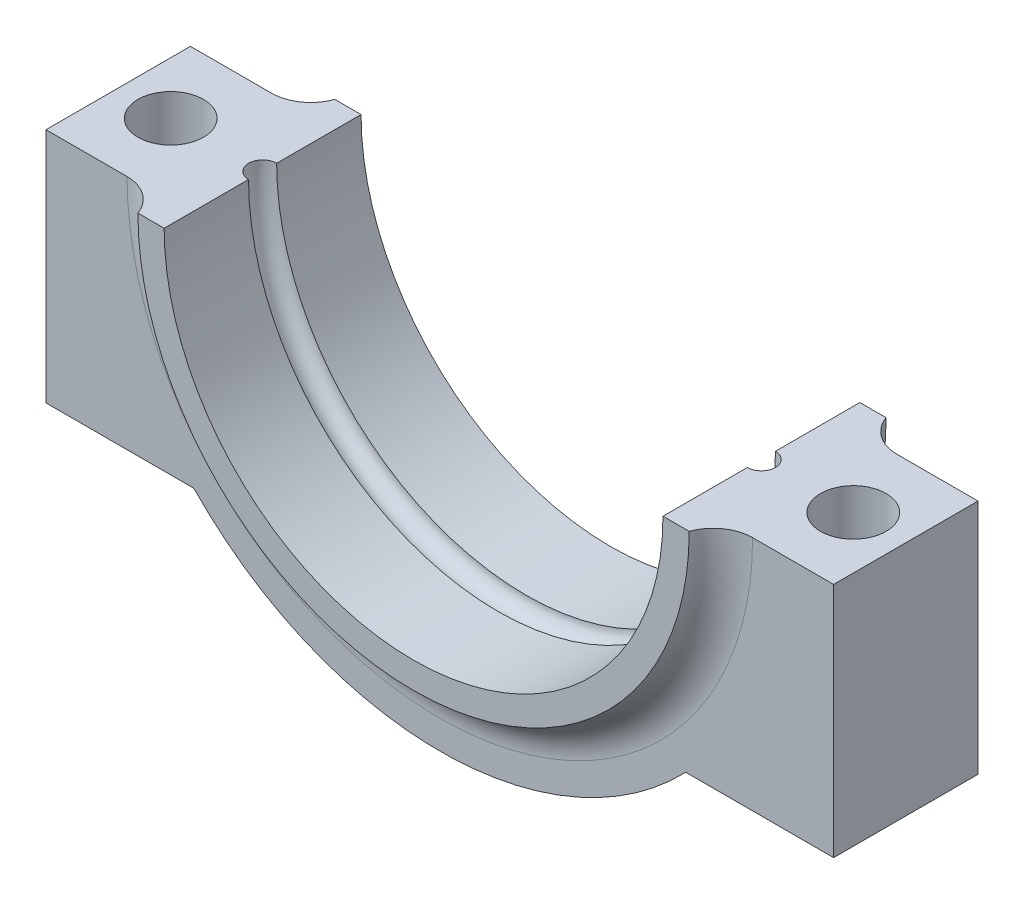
ISO-10303-21;
HEADER;
FILE_DESCRIPTION(('STEP AP214'),'2;1');
FILE_NAME('part.step','',(''),(''),'','','');
FILE_SCHEMA(('AUTOMOTIVE_DESIGN { 1 0 10303 214 1 1 1 1 }'));
ENDSEC;
DATA;
#1=APPLICATION_CONTEXT('core data for automotive mechanical design processes');
#2=APPLICATION_PROTOCOL_DEFINITION('international standard','automotive_design',2000,#1);
#3=PRODUCT_CONTEXT('',#1,'mechanical');
#4=PRODUCT('Part','Part','',(#3));
#5=PRODUCT_RELATED_PRODUCT_CATEGORY('part','',(#4));
#6=PRODUCT_DEFINITION_FORMATION('','',#4);
#7=PRODUCT_DEFINITION_CONTEXT('part definition',#1,'design');
#8=PRODUCT_DEFINITION('design','',#6,#7);
#9=PRODUCT_DEFINITION_SHAPE('','',#8);
#10=(LENGTH_UNIT() NAMED_UNIT(*) SI_UNIT(.MILLI.,.METRE.));
#11=(NAMED_UNIT(*) PLANE_ANGLE_UNIT() SI_UNIT($,.RADIAN.));
#12=(NAMED_UNIT(*) SI_UNIT($,.STERADIAN.) SOLID_ANGLE_UNIT());
#13=UNCERTAINTY_MEASURE_WITH_UNIT(LENGTH_MEASURE(1.E-05),#10,'distance_accuracy_value','');
#14=(GEOMETRIC_REPRESENTATION_CONTEXT(3) GLOBAL_UNCERTAINTY_ASSIGNED_CONTEXT((#13)) GLOBAL_UNIT_ASSIGNED_CONTEXT((#10,
#11,#12)) REPRESENTATION_CONTEXT('',''));
#15=CARTESIAN_POINT('',(0.,0.,0.));
#16=DIRECTION('',(0.,0.,1.));
#17=DIRECTION('',(1.,0.,0.));
#18=AXIS2_PLACEMENT_3D('',#15,#16,#17);
#19=CARTESIAN_POINT('',(0.,0.,5.5));
#20=DIRECTION('',(0.,0.,-1.));
#21=DIRECTION('',(-1.,0.,0.));
#22=AXIS2_PLACEMENT_3D('',#19,#20,#21);
#23=CYLINDRICAL_SURFACE('',#22,19.);
#24=DIRECTION('',(0.,0.,-1.));
#25=VECTOR('',#24,1.);
#26=CARTESIAN_POINT('',(-19.,0.,5.5));
#27=LINE('',#26,#25);
#28=CARTESIAN_POINT('',(-19.,0.,-1.07));
#29=VERTEX_POINT('',#28);
#30=CARTESIAN_POINT('',(-19.,0.,-7.5));
#31=VERTEX_POINT('',#30);
#32=EDGE_CURVE('E142',#29,#31,#27,.T.);
#33=ORIENTED_EDGE('',*,*,#32,.F.);
#34=CARTESIAN_POINT('',(0.,0.,-1.07));
#35=DIRECTION('',(0.,0.,1.));
#36=DIRECTION('',(1.,0.,0.));
#37=AXIS2_PLACEMENT_3D('',#34,#35,#36);
#38=CIRCLE('',#37,19.);
#39=CARTESIAN_POINT('',(19.,0.,-1.07));
#40=VERTEX_POINT('',#39);
#41=EDGE_CURVE('E132',#29,#40,#38,.T.);
#42=ORIENTED_EDGE('',*,*,#41,.T.);
#43=DIRECTION('',(0.,0.,-1.));
#44=VECTOR('',#43,1.);
#45=CARTESIAN_POINT('',(19.,0.,5.5));
#46=LINE('',#45,#44);
#47=CARTESIAN_POINT('',(19.,0.,-7.5));
#48=VERTEX_POINT('',#47);
#49=EDGE_CURVE('E140',#40,#48,#46,.T.);
#50=ORIENTED_EDGE('',*,*,#49,.T.);
#51=CARTESIAN_POINT('',(0.,0.,-7.5));
#52=DIRECTION('',(0.,0.,-1.));
#53=DIRECTION('',(1.,0.,0.));
#54=AXIS2_PLACEMENT_3D('',#51,#52,#53);
#55=CIRCLE('',#54,19.);
#56=EDGE_CURVE('E283',#48,#31,#55,.T.);
#57=ORIENTED_EDGE('',*,*,#56,.T.);
#58=EDGE_LOOP('',(#33,#42,#50,#57));
#59=FACE_BOUND('',#58,.T.);
#60=ADVANCED_FACE('F32',(#59),#23,.F.);
#61=CARTESIAN_POINT('',(19.,0.,7.5));
#62=VERTEX_POINT('',#61);
#63=CARTESIAN_POINT('',(19.,0.,1.07));
#64=VERTEX_POINT('',#63);
#65=EDGE_CURVE('E149',#62,#64,#46,.T.);
#66=ORIENTED_EDGE('',*,*,#65,.T.);
#67=CARTESIAN_POINT('',(0.,0.,1.07));
#68=DIRECTION('',(0.,0.,-1.));
#69=DIRECTION('',(-1.,0.,0.));
#70=AXIS2_PLACEMENT_3D('',#67,#68,#69);
#71=CIRCLE('',#70,19.);
#72=CARTESIAN_POINT('',(-19.,0.,1.07));
#73=VERTEX_POINT('',#72);
#74=EDGE_CURVE('E47',#64,#73,#71,.T.);
#75=ORIENTED_EDGE('',*,*,#74,.T.);
#76=CARTESIAN_POINT('',(-19.,0.,7.5));
#77=VERTEX_POINT('',#76);
#78=EDGE_CURVE('E177',#77,#73,#27,.T.);
#79=ORIENTED_EDGE('',*,*,#78,.F.);
#80=CARTESIAN_POINT('',(0.,0.,7.5));
#81=DIRECTION('',(0.,0.,-1.));
#82=DIRECTION('',(1.,0.,0.));
#83=AXIS2_PLACEMENT_3D('',#80,#81,#82);
#84=CIRCLE('',#83,19.);
#85=EDGE_CURVE('E300',#62,#77,#84,.T.);
#86=ORIENTED_EDGE('',*,*,#85,.F.);
#87=EDGE_LOOP('',(#66,#75,#79,#86));
#88=FACE_BOUND('',#87,.T.);
#89=ADVANCED_FACE('F228',(#88),#23,.F.);
#90=CARTESIAN_POINT('',(-30.,0.,5.5));
#91=DIRECTION('',(0.,-1.,0.));
#92=DIRECTION('',(0.,0.,-1.));
#93=AXIS2_PLACEMENT_3D('',#90,#91,#92);
#94=PLANE('',#93);
#95=CARTESIAN_POINT('',(-26.,0.,0.));
#96=DIRECTION('',(0.,1.,0.));
#97=DIRECTION('',(0.,0.,1.));
#98=AXIS2_PLACEMENT_3D('',#95,#96,#97);
#99=CIRCLE('',#98,2.5);
#100=CARTESIAN_POINT('',(-26.,0.,2.5));
#101=VERTEX_POINT('',#100);
#102=EDGE_CURVE('E297',#101,#101,#99,.T.);
#103=ORIENTED_EDGE('',*,*,#102,.F.);
#104=EDGE_LOOP('',(#103));
#105=FACE_BOUND('',#104,.T.);
#106=ORIENTED_EDGE('',*,*,#78,.T.);
#107=CARTESIAN_POINT('',(-19.,0.,0.));
#108=DIRECTION('',(0.,-1.,0.));
#109=DIRECTION('',(0.,0.,-1.));
#110=AXIS2_PLACEMENT_3D('',#107,#108,#109);
#111=CIRCLE('',#110,1.07);
#112=EDGE_CURVE('E143',#73,#29,#111,.T.);
#113=ORIENTED_EDGE('',*,*,#112,.T.);
#114=ORIENTED_EDGE('',*,*,#32,.T.);
#115=DIRECTION('',(-1.,0.,0.));
#116=VECTOR('',#115,1.);
#117=CARTESIAN_POINT('',(-19.,0.,-7.5));
#118=LINE('',#117,#116);
#119=CARTESIAN_POINT('',(-21.,0.,-7.5));
#120=VERTEX_POINT('',#119);
#121=EDGE_CURVE('E211',#31,#120,#118,.T.);
#122=ORIENTED_EDGE('',*,*,#121,.T.);
#123=CARTESIAN_POINT('',(-23.8284271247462,0.,-8.5));
#124=DIRECTION('',(0.,-1.,0.));
#125=DIRECTION('',(0.,0.,-1.));
#126=AXIS2_PLACEMENT_3D('',#123,#124,#125);
#127=CIRCLE('',#126,3.);
#128=CARTESIAN_POINT('',(-23.8284271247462,0.,-5.5));
#129=VERTEX_POINT('',#128);
#130=EDGE_CURVE('E40',#120,#129,#127,.T.);
#131=ORIENTED_EDGE('',*,*,#130,.T.);
#132=DIRECTION('',(-1.,0.,0.));
#133=VECTOR('',#132,1.);
#134=CARTESIAN_POINT('',(-30.,0.,-5.5));
#135=LINE('',#134,#133);
#136=CARTESIAN_POINT('',(-30.,0.,-5.5));
#137=VERTEX_POINT('',#136);
#138=EDGE_CURVE('E193',#129,#137,#135,.T.);
#139=ORIENTED_EDGE('',*,*,#138,.T.);
#140=DIRECTION('',(0.,0.,-1.));
#141=VECTOR('',#140,1.);
#142=CARTESIAN_POINT('',(-30.,0.,5.5));
#143=LINE('',#142,#141);
#144=CARTESIAN_POINT('',(-30.,0.,5.5));
#145=VERTEX_POINT('',#144);
#146=EDGE_CURVE('E174',#145,#137,#143,.T.);
#147=ORIENTED_EDGE('',*,*,#146,.F.);
#148=DIRECTION('',(-1.,0.,0.));
#149=VECTOR('',#148,1.);
#150=CARTESIAN_POINT('',(-30.,0.,5.5));
#151=LINE('',#150,#149);
#152=CARTESIAN_POINT('',(-23.8284271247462,0.,5.5));
#153=VERTEX_POINT('',#152);
#154=EDGE_CURVE('E315',#153,#145,#151,.T.);
#155=ORIENTED_EDGE('',*,*,#154,.F.);
#156=CARTESIAN_POINT('',(-23.8284271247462,0.,8.5));
#157=DIRECTION('',(0.,-1.,0.));
#158=DIRECTION('',(0.,0.,-1.));
#159=AXIS2_PLACEMENT_3D('',#156,#157,#158);
#160=CIRCLE('',#159,3.);
#161=CARTESIAN_POINT('',(-21.,0.,7.5));
#162=VERTEX_POINT('',#161);
#163=EDGE_CURVE('E202',#153,#162,#160,.T.);
#164=ORIENTED_EDGE('',*,*,#163,.T.);
#165=DIRECTION('',(-1.,0.,0.));
#166=VECTOR('',#165,1.);
#167=CARTESIAN_POINT('',(-19.,0.,7.5));
#168=LINE('',#167,#166);
#169=EDGE_CURVE('E303',#77,#162,#168,.T.);
#170=ORIENTED_EDGE('',*,*,#169,.F.);
#171=EDGE_LOOP('',(#106,#113,#114,#122,#131,#139,#147,#155,#164,#170));
#172=FACE_BOUND('',#171,.T.);
#173=ADVANCED_FACE('F208',(#105,#172),#94,.F.);
#174=CARTESIAN_POINT('',(-30.,-18.02775637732,5.5));
#175=DIRECTION('',(1.,0.,0.));
#176=DIRECTION('',(0.,0.,-1.));
#177=AXIS2_PLACEMENT_3D('',#174,#175,#176);
#178=PLANE('',#177);
#179=DIRECTION('',(0.,-1.,0.));
#180=VECTOR('',#179,1.);
#181=CARTESIAN_POINT('',(-30.,-18.02775637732,-5.5));
#182=LINE('',#181,#180);
#183=CARTESIAN_POINT('',(-30.,-18.02775637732,-5.5));
#184=VERTEX_POINT('',#183);
#185=EDGE_CURVE('E190',#137,#184,#182,.T.);
#186=ORIENTED_EDGE('',*,*,#185,.T.);
#187=DIRECTION('',(0.,0.,-1.));
#188=VECTOR('',#187,1.);
#189=CARTESIAN_POINT('',(-30.,-18.02775637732,5.5));
#190=LINE('',#189,#188);
#191=CARTESIAN_POINT('',(-30.,-18.02775637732,5.5));
#192=VERTEX_POINT('',#191);
#193=EDGE_CURVE('E171',#192,#184,#190,.T.);
#194=ORIENTED_EDGE('',*,*,#193,.F.);
#195=DIRECTION('',(0.,-1.,0.));
#196=VECTOR('',#195,1.);
#197=CARTESIAN_POINT('',(-30.,-18.02775637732,5.5));
#198=LINE('',#197,#196);
#199=EDGE_CURVE('E313',#145,#192,#198,.T.);
#200=ORIENTED_EDGE('',*,*,#199,.F.);
#201=ORIENTED_EDGE('',*,*,#146,.T.);
#202=EDGE_LOOP('',(#186,#194,#200,#201));
#203=FACE_BOUND('',#202,.T.);
#204=ADVANCED_FACE('F237',(#203),#178,.F.);
#205=CARTESIAN_POINT('',(-30.,-18.02775637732,5.5));
#206=DIRECTION('',(0.,1.,0.));
#207=DIRECTION('',(0.,0.,1.));
#208=AXIS2_PLACEMENT_3D('',#205,#206,#207);
#209=PLANE('',#208);
#210=CARTESIAN_POINT('',(-26.,-18.02775637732,0.));
#211=DIRECTION('',(0.,1.,0.));
#212=DIRECTION('',(0.,0.,1.));
#213=AXIS2_PLACEMENT_3D('',#210,#211,#212);
#214=CIRCLE('',#213,2.5);
#215=CARTESIAN_POINT('',(-26.,-18.02775637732,2.5));
#216=VERTEX_POINT('',#215);
#217=EDGE_CURVE('E182',#216,#216,#214,.T.);
#218=ORIENTED_EDGE('',*,*,#217,.T.);
#219=EDGE_LOOP('',(#218));
#220=FACE_BOUND('',#219,.T.);
#221=DIRECTION('',(1.,0.,0.));
#222=VECTOR('',#221,1.);
#223=CARTESIAN_POINT('',(-30.,-18.02775637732,-5.5));
#224=LINE('',#223,#222);
#225=CARTESIAN_POINT('',(-18.7349939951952,-18.02775637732,-5.5));
#226=VERTEX_POINT('',#225);
#227=EDGE_CURVE('E324',#184,#226,#224,.T.);
#228=ORIENTED_EDGE('',*,*,#227,.T.);
#229=DIRECTION('',(0.,0.,-1.));
#230=VECTOR('',#229,1.);
#231=CARTESIAN_POINT('',(-18.7349939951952,-18.02775637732,5.5));
#232=LINE('',#231,#230);
#233=CARTESIAN_POINT('',(-18.7349939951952,-18.02775637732,5.5));
#234=VERTEX_POINT('',#233);
#235=EDGE_CURVE('E168',#234,#226,#232,.T.);
#236=ORIENTED_EDGE('',*,*,#235,.F.);
#237=DIRECTION('',(1.,0.,0.));
#238=VECTOR('',#237,1.);
#239=CARTESIAN_POINT('',(-30.,-18.02775637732,5.5));
#240=LINE('',#239,#238);
#241=EDGE_CURVE('E330',#192,#234,#240,.T.);
#242=ORIENTED_EDGE('',*,*,#241,.F.);
#243=ORIENTED_EDGE('',*,*,#193,.T.);
#244=EDGE_LOOP('',(#228,#236,#242,#243));
#245=FACE_BOUND('',#244,.T.);
#246=ADVANCED_FACE('F241',(#220,#245),#209,.F.);
#247=CARTESIAN_POINT('',(0.,0.,5.5));
#248=DIRECTION('',(0.,0.,-1.));
#249=DIRECTION('',(-1.,0.,0.));
#250=AXIS2_PLACEMENT_3D('',#247,#248,#249);
#251=CYLINDRICAL_SURFACE('',#250,26.);
#252=CARTESIAN_POINT('',(0.,0.,-5.5));
#253=DIRECTION('',(0.,0.,1.));
#254=DIRECTION('',(1.,0.,0.));
#255=AXIS2_PLACEMENT_3D('',#252,#253,#254);
#256=CIRCLE('',#255,26.);
#257=CARTESIAN_POINT('',(18.7349939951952,-18.0277563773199,-5.5));
#258=VERTEX_POINT('',#257);
#259=EDGE_CURVE('E321',#226,#258,#256,.T.);
#260=ORIENTED_EDGE('',*,*,#259,.T.);
#261=DIRECTION('',(0.,0.,-1.));
#262=VECTOR('',#261,1.);
#263=CARTESIAN_POINT('',(18.7349939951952,-18.0277563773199,5.5));
#264=LINE('',#263,#262);
#265=CARTESIAN_POINT('',(18.7349939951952,-18.0277563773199,5.5));
#266=VERTEX_POINT('',#265);
#267=EDGE_CURVE('E165',#266,#258,#264,.T.);
#268=ORIENTED_EDGE('',*,*,#267,.F.);
#269=CARTESIAN_POINT('',(0.,0.,5.5));
#270=DIRECTION('',(0.,0.,1.));
#271=DIRECTION('',(1.,0.,0.));
#272=AXIS2_PLACEMENT_3D('',#269,#270,#271);
#273=CIRCLE('',#272,26.);
#274=EDGE_CURVE('E340',#234,#266,#273,.T.);
#275=ORIENTED_EDGE('',*,*,#274,.F.);
#276=ORIENTED_EDGE('',*,*,#235,.T.);
#277=EDGE_LOOP('',(#260,#268,#275,#276));
#278=FACE_BOUND('',#277,.T.);
#279=ADVANCED_FACE('F245',(#278),#251,.T.);
#280=CARTESIAN_POINT('',(30.,-18.0277563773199,5.5));
#281=DIRECTION('',(0.,1.,0.));
#282=DIRECTION('',(0.,0.,1.));
#283=AXIS2_PLACEMENT_3D('',#280,#281,#282);
#284=PLANE('',#283);
#285=CARTESIAN_POINT('',(26.,-18.0277563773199,0.));
#286=DIRECTION('',(0.,1.,0.));
#287=DIRECTION('',(0.,0.,1.));
#288=AXIS2_PLACEMENT_3D('',#285,#286,#287);
#289=CIRCLE('',#288,2.5);
#290=CARTESIAN_POINT('',(26.,-18.0277563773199,2.5));
#291=VERTEX_POINT('',#290);
#292=EDGE_CURVE('E294',#291,#291,#289,.T.);
#293=ORIENTED_EDGE('',*,*,#292,.T.);
#294=EDGE_LOOP('',(#293));
#295=FACE_BOUND('',#294,.T.);
#296=DIRECTION('',(1.,0.,0.));
#297=VECTOR('',#296,1.);
#298=CARTESIAN_POINT('',(30.,-18.0277563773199,-5.5));
#299=LINE('',#298,#297);
#300=CARTESIAN_POINT('',(30.,-18.0277563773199,-5.5));
#301=VERTEX_POINT('',#300);
#302=EDGE_CURVE('E318',#258,#301,#299,.T.);
#303=ORIENTED_EDGE('',*,*,#302,.T.);
#304=DIRECTION('',(0.,0.,-1.));
#305=VECTOR('',#304,1.);
#306=CARTESIAN_POINT('',(30.,-18.0277563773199,5.5));
#307=LINE('',#306,#305);
#308=CARTESIAN_POINT('',(30.,-18.0277563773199,5.5));
#309=VERTEX_POINT('',#308);
#310=EDGE_CURVE('E162',#309,#301,#307,.T.);
#311=ORIENTED_EDGE('',*,*,#310,.F.);
#312=DIRECTION('',(1.,0.,0.));
#313=VECTOR('',#312,1.);
#314=CARTESIAN_POINT('',(30.,-18.0277563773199,5.5));
#315=LINE('',#314,#313);
#316=EDGE_CURVE('E338',#266,#309,#315,.T.);
#317=ORIENTED_EDGE('',*,*,#316,.F.);
#318=ORIENTED_EDGE('',*,*,#267,.T.);
#319=EDGE_LOOP('',(#303,#311,#317,#318));
#320=FACE_BOUND('',#319,.T.);
#321=ADVANCED_FACE('F249',(#295,#320),#284,.F.);
#322=CARTESIAN_POINT('',(30.,-18.0277563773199,5.5));
#323=DIRECTION('',(-1.,0.,0.));
#324=DIRECTION('',(0.,0.,1.));
#325=AXIS2_PLACEMENT_3D('',#322,#323,#324);
#326=PLANE('',#325);
#327=DIRECTION('',(0.,1.,0.));
#328=VECTOR('',#327,1.);
#329=CARTESIAN_POINT('',(30.,-18.0277563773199,-5.5));
#330=LINE('',#329,#328);
#331=CARTESIAN_POINT('',(30.,0.,-5.5));
#332=VERTEX_POINT('',#331);
#333=EDGE_CURVE('E317',#301,#332,#330,.T.);
#334=ORIENTED_EDGE('',*,*,#333,.T.);
#335=DIRECTION('',(0.,0.,-1.));
#336=VECTOR('',#335,1.);
#337=CARTESIAN_POINT('',(30.,0.,5.5));
#338=LINE('',#337,#336);
#339=CARTESIAN_POINT('',(30.,0.,5.5));
#340=VERTEX_POINT('',#339);
#341=EDGE_CURVE('E152',#340,#332,#338,.T.);
#342=ORIENTED_EDGE('',*,*,#341,.F.);
#343=DIRECTION('',(0.,1.,0.));
#344=VECTOR('',#343,1.);
#345=CARTESIAN_POINT('',(30.,-18.0277563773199,5.5));
#346=LINE('',#345,#344);
#347=EDGE_CURVE('E154',#309,#340,#346,.T.);
#348=ORIENTED_EDGE('',*,*,#347,.F.);
#349=ORIENTED_EDGE('',*,*,#310,.T.);
#350=EDGE_LOOP('',(#334,#342,#348,#349));
#351=FACE_BOUND('',#350,.T.);
#352=ADVANCED_FACE('F253',(#351),#326,.F.);
#353=CARTESIAN_POINT('',(19.,0.,5.5));
#354=DIRECTION('',(0.,-1.,0.));
#355=DIRECTION('',(0.,0.,-1.));
#356=AXIS2_PLACEMENT_3D('',#353,#354,#355);
#357=PLANE('',#356);
#358=CARTESIAN_POINT('',(26.,0.,0.));
#359=DIRECTION('',(0.,1.,0.));
#360=DIRECTION('',(0.,0.,1.));
#361=AXIS2_PLACEMENT_3D('',#358,#359,#360);
#362=CIRCLE('',#361,2.5);
#363=CARTESIAN_POINT('',(26.,0.,2.5));
#364=VERTEX_POINT('',#363);
#365=EDGE_CURVE('E291',#364,#364,#362,.T.);
#366=ORIENTED_EDGE('',*,*,#365,.F.);
#367=EDGE_LOOP('',(#366));
#368=FACE_BOUND('',#367,.T.);
#369=ORIENTED_EDGE('',*,*,#49,.F.);
#370=CARTESIAN_POINT('',(19.,0.,0.));
#371=DIRECTION('',(0.,-1.,0.));
#372=DIRECTION('',(0.,0.,-1.));
#373=AXIS2_PLACEMENT_3D('',#370,#371,#372);
#374=CIRCLE('',#373,1.07);
#375=EDGE_CURVE('E11',#40,#64,#374,.T.);
#376=ORIENTED_EDGE('',*,*,#375,.T.);
#377=ORIENTED_EDGE('',*,*,#65,.F.);
#378=DIRECTION('',(-1.,0.,0.));
#379=VECTOR('',#378,1.);
#380=CARTESIAN_POINT('',(19.,0.,7.5));
#381=LINE('',#380,#379);
#382=CARTESIAN_POINT('',(21.,0.,7.5));
#383=VERTEX_POINT('',#382);
#384=EDGE_CURVE('E196',#383,#62,#381,.T.);
#385=ORIENTED_EDGE('',*,*,#384,.F.);
#386=CARTESIAN_POINT('',(23.8284271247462,0.,8.5));
#387=DIRECTION('',(0.,-1.,0.));
#388=DIRECTION('',(0.,0.,-1.));
#389=AXIS2_PLACEMENT_3D('',#386,#387,#388);
#390=CIRCLE('',#389,3.);
#391=CARTESIAN_POINT('',(23.8284271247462,0.,5.5));
#392=VERTEX_POINT('',#391);
#393=EDGE_CURVE('E200',#383,#392,#390,.T.);
#394=ORIENTED_EDGE('',*,*,#393,.T.);
#395=DIRECTION('',(-1.,0.,0.));
#396=VECTOR('',#395,1.);
#397=CARTESIAN_POINT('',(19.,0.,5.5));
#398=LINE('',#397,#396);
#399=EDGE_CURVE('E150',#340,#392,#398,.T.);
#400=ORIENTED_EDGE('',*,*,#399,.F.);
#401=ORIENTED_EDGE('',*,*,#341,.T.);
#402=DIRECTION('',(-1.,0.,0.));
#403=VECTOR('',#402,1.);
#404=CARTESIAN_POINT('',(19.,0.,-5.5));
#405=LINE('',#404,#403);
#406=CARTESIAN_POINT('',(23.8284271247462,0.,-5.5));
#407=VERTEX_POINT('',#406);
#408=EDGE_CURVE('E316',#332,#407,#405,.T.);
#409=ORIENTED_EDGE('',*,*,#408,.T.);
#410=CARTESIAN_POINT('',(23.8284271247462,0.,-8.5));
#411=DIRECTION('',(0.,-1.,0.));
#412=DIRECTION('',(0.,0.,-1.));
#413=AXIS2_PLACEMENT_3D('',#410,#411,#412);
#414=CIRCLE('',#413,3.);
#415=CARTESIAN_POINT('',(21.,0.,-7.5));
#416=VERTEX_POINT('',#415);
#417=EDGE_CURVE('E54',#407,#416,#414,.T.);
#418=ORIENTED_EDGE('',*,*,#417,.T.);
#419=DIRECTION('',(-1.,0.,0.));
#420=VECTOR('',#419,1.);
#421=CARTESIAN_POINT('',(19.,0.,-7.5));
#422=LINE('',#421,#420);
#423=EDGE_CURVE('E148',#416,#48,#422,.T.);
#424=ORIENTED_EDGE('',*,*,#423,.T.);
#425=EDGE_LOOP('',(#369,#376,#377,#385,#394,#400,#401,#409,#418,#424));
#426=FACE_BOUND('',#425,.T.);
#427=ADVANCED_FACE('F146',(#368,#426),#357,.F.);
#428=CARTESIAN_POINT('',(0.,0.,5.5));
#429=DIRECTION('',(0.,0.,1.));
#430=DIRECTION('',(1.,0.,0.));
#431=AXIS2_PLACEMENT_3D('',#428,#429,#430);
#432=PLANE('',#431);
#433=ORIENTED_EDGE('',*,*,#399,.T.);
#434=CARTESIAN_POINT('',(0.,0.,5.5));
#435=DIRECTION('',(0.,0.,1.));
#436=DIRECTION('',(1.,0.,0.));
#437=AXIS2_PLACEMENT_3D('',#434,#435,#436);
#438=CIRCLE('',#437,23.8284271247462);
#439=EDGE_CURVE('E179',#392,#153,#438,.F.);
#440=ORIENTED_EDGE('',*,*,#439,.T.);
#441=ORIENTED_EDGE('',*,*,#154,.T.);
#442=ORIENTED_EDGE('',*,*,#199,.T.);
#443=ORIENTED_EDGE('',*,*,#241,.T.);
#444=ORIENTED_EDGE('',*,*,#274,.T.);
#445=ORIENTED_EDGE('',*,*,#316,.T.);
#446=ORIENTED_EDGE('',*,*,#347,.T.);
#447=EDGE_LOOP('',(#433,#440,#441,#442,#443,#444,#445,#446));
#448=FACE_BOUND('',#447,.T.);
#449=ADVANCED_FACE('F260',(#448),#432,.T.);
#450=CARTESIAN_POINT('',(0.,0.,-5.5));
#451=DIRECTION('',(0.,0.,1.));
#452=DIRECTION('',(1.,0.,0.));
#453=AXIS2_PLACEMENT_3D('',#450,#451,#452);
#454=PLANE('',#453);
#455=ORIENTED_EDGE('',*,*,#138,.F.);
#456=CARTESIAN_POINT('',(0.,0.,-5.5));
#457=DIRECTION('',(0.,0.,1.));
#458=DIRECTION('',(1.,0.,0.));
#459=AXIS2_PLACEMENT_3D('',#456,#457,#458);
#460=CIRCLE('',#459,23.8284271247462);
#461=EDGE_CURVE('E198',#129,#407,#460,.T.);
#462=ORIENTED_EDGE('',*,*,#461,.T.);
#463=ORIENTED_EDGE('',*,*,#408,.F.);
#464=ORIENTED_EDGE('',*,*,#333,.F.);
#465=ORIENTED_EDGE('',*,*,#302,.F.);
#466=ORIENTED_EDGE('',*,*,#259,.F.);
#467=ORIENTED_EDGE('',*,*,#227,.F.);
#468=ORIENTED_EDGE('',*,*,#185,.F.);
#469=EDGE_LOOP('',(#455,#462,#463,#464,#465,#466,#467,#468));
#470=FACE_BOUND('',#469,.T.);
#471=ADVANCED_FACE('F214',(#470),#454,.F.);
#472=CARTESIAN_POINT('',(0.,0.,7.5));
#473=DIRECTION('',(0.,0.,1.));
#474=DIRECTION('',(1.,0.,0.));
#475=AXIS2_PLACEMENT_3D('',#472,#473,#474);
#476=PLANE('',#475);
#477=ORIENTED_EDGE('',*,*,#85,.T.);
#478=ORIENTED_EDGE('',*,*,#169,.T.);
#479=CARTESIAN_POINT('',(0.,0.,7.5));
#480=DIRECTION('',(0.,0.,1.));
#481=DIRECTION('',(1.,0.,0.));
#482=AXIS2_PLACEMENT_3D('',#479,#480,#481);
#483=CIRCLE('',#482,21.);
#484=EDGE_CURVE('E306',#162,#383,#483,.T.);
#485=ORIENTED_EDGE('',*,*,#484,.T.);
#486=ORIENTED_EDGE('',*,*,#384,.T.);
#487=EDGE_LOOP('',(#477,#478,#485,#486));
#488=FACE_BOUND('',#487,.T.);
#489=ADVANCED_FACE('F264',(#488),#476,.T.);
#490=CARTESIAN_POINT('',(-26.,-54.,0.));
#491=DIRECTION('',(0.,1.,0.));
#492=DIRECTION('',(0.,0.,1.));
#493=AXIS2_PLACEMENT_3D('',#490,#491,#492);
#494=CYLINDRICAL_SURFACE('',#493,2.5);
#495=ORIENTED_EDGE('',*,*,#102,.T.);
#496=EDGE_LOOP('',(#495));
#497=FACE_BOUND('',#496,.T.);
#498=ORIENTED_EDGE('',*,*,#217,.F.);
#499=EDGE_LOOP('',(#498));
#500=FACE_BOUND('',#499,.T.);
#501=ADVANCED_FACE('F270',(#497,#500),#494,.F.);
#502=CARTESIAN_POINT('',(26.,-54.,0.));
#503=DIRECTION('',(0.,1.,0.));
#504=DIRECTION('',(0.,0.,1.));
#505=AXIS2_PLACEMENT_3D('',#502,#503,#504);
#506=CYLINDRICAL_SURFACE('',#505,2.5);
#507=ORIENTED_EDGE('',*,*,#365,.T.);
#508=EDGE_LOOP('',(#507));
#509=FACE_BOUND('',#508,.T.);
#510=ORIENTED_EDGE('',*,*,#292,.F.);
#511=EDGE_LOOP('',(#510));
#512=FACE_BOUND('',#511,.T.);
#513=ADVANCED_FACE('F274',(#509,#512),#506,.F.);
#514=CARTESIAN_POINT('',(0.,0.,-7.5));
#515=DIRECTION('',(0.,0.,-1.));
#516=DIRECTION('',(1.,0.,0.));
#517=AXIS2_PLACEMENT_3D('',#514,#515,#516);
#518=PLANE('',#517);
#519=ORIENTED_EDGE('',*,*,#56,.F.);
#520=ORIENTED_EDGE('',*,*,#423,.F.);
#521=CARTESIAN_POINT('',(0.,0.,-7.5));
#522=DIRECTION('',(0.,0.,1.));
#523=DIRECTION('',(1.,0.,0.));
#524=AXIS2_PLACEMENT_3D('',#521,#522,#523);
#525=CIRCLE('',#524,21.);
#526=EDGE_CURVE('E285',#120,#416,#525,.T.);
#527=ORIENTED_EDGE('',*,*,#526,.F.);
#528=ORIENTED_EDGE('',*,*,#121,.F.);
#529=EDGE_LOOP('',(#519,#520,#527,#528));
#530=FACE_BOUND('',#529,.T.);
#531=ADVANCED_FACE('F225',(#530),#518,.T.);
#532=CARTESIAN_POINT('',(0.,0.,8.5));
#533=DIRECTION('',(0.,0.,1.));
#534=DIRECTION('',(1.,0.,0.));
#535=AXIS2_PLACEMENT_3D('',#532,#533,#534);
#536=TOROIDAL_SURFACE('',#535,23.8284271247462,3.);
#537=ORIENTED_EDGE('',*,*,#163,.F.);
#538=ORIENTED_EDGE('',*,*,#439,.F.);
#539=ORIENTED_EDGE('',*,*,#393,.F.);
#540=ORIENTED_EDGE('',*,*,#484,.F.);
#541=EDGE_LOOP('',(#537,#538,#539,#540));
#542=FACE_BOUND('',#541,.T.);
#543=ADVANCED_FACE('F219',(#542),#536,.F.);
#544=CARTESIAN_POINT('',(0.,0.,-8.5));
#545=DIRECTION('',(0.,0.,1.));
#546=DIRECTION('',(1.,0.,0.));
#547=AXIS2_PLACEMENT_3D('',#544,#545,#546);
#548=TOROIDAL_SURFACE('',#547,23.8284271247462,3.);
#549=ORIENTED_EDGE('',*,*,#130,.F.);
#550=ORIENTED_EDGE('',*,*,#526,.T.);
#551=ORIENTED_EDGE('',*,*,#417,.F.);
#552=ORIENTED_EDGE('',*,*,#461,.F.);
#553=EDGE_LOOP('',(#549,#550,#551,#552));
#554=FACE_BOUND('',#553,.T.);
#555=ADVANCED_FACE('F34',(#554),#548,.F.);
#556=CARTESIAN_POINT('',(0.,0.,0.));
#557=DIRECTION('',(0.,0.,-1.));
#558=DIRECTION('',(-1.,0.,0.));
#559=AXIS2_PLACEMENT_3D('',#556,#557,#558);
#560=TOROIDAL_SURFACE('',#559,19.,1.07);
#561=ORIENTED_EDGE('',*,*,#74,.F.);
#562=ORIENTED_EDGE('',*,*,#375,.F.);
#563=ORIENTED_EDGE('',*,*,#41,.F.);
#564=ORIENTED_EDGE('',*,*,#112,.F.);
#565=EDGE_LOOP('',(#561,#562,#563,#564));
#566=FACE_BOUND('',#565,.T.);
#567=ADVANCED_FACE('F131',(#566),#560,.F.);
#568=CLOSED_SHELL('',(#60,#89,#173,#204,#246,#279,#321,#352,#427,#449,#471,#489,#501,#513,#531,
#543,#555,#567));
#569=MANIFOLD_SOLID_BREP('B2',#568);
#570=ADVANCED_BREP_SHAPE_REPRESENTATION('',(#18,#569),#14);
#571=SHAPE_DEFINITION_REPRESENTATION(#9,#570);
ENDSEC;
END-ISO-10303-21;
